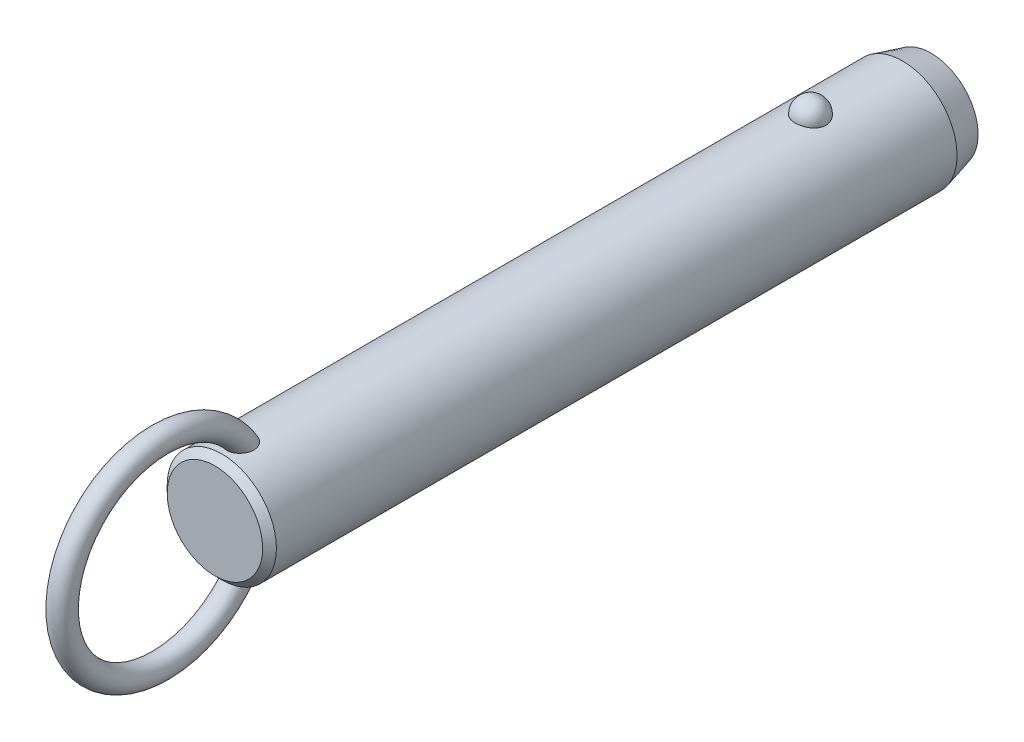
ISO-10303-21;
HEADER;
FILE_DESCRIPTION(('STEP AP214'),'2;1');
FILE_NAME('part.step','',(''),(''),'','','');
FILE_SCHEMA(('AUTOMOTIVE_DESIGN { 1 0 10303 214 1 1 1 1 }'));
ENDSEC;
DATA;
#1=APPLICATION_CONTEXT('core data for automotive mechanical design processes');
#2=APPLICATION_PROTOCOL_DEFINITION('international standard','automotive_design',2000,#1);
#3=PRODUCT_CONTEXT('',#1,'mechanical');
#4=PRODUCT('Part','Part','',(#3));
#5=PRODUCT_RELATED_PRODUCT_CATEGORY('part','',(#4));
#6=PRODUCT_DEFINITION_FORMATION('','',#4);
#7=PRODUCT_DEFINITION_CONTEXT('part definition',#1,'design');
#8=PRODUCT_DEFINITION('design','',#6,#7);
#9=PRODUCT_DEFINITION_SHAPE('','',#8);
#10=(LENGTH_UNIT() NAMED_UNIT(*) SI_UNIT(.MILLI.,.METRE.));
#11=(NAMED_UNIT(*) PLANE_ANGLE_UNIT() SI_UNIT($,.RADIAN.));
#12=(NAMED_UNIT(*) SI_UNIT($,.STERADIAN.) SOLID_ANGLE_UNIT());
#13=UNCERTAINTY_MEASURE_WITH_UNIT(LENGTH_MEASURE(1.E-05),#10,'distance_accuracy_value','');
#14=(GEOMETRIC_REPRESENTATION_CONTEXT(3) GLOBAL_UNCERTAINTY_ASSIGNED_CONTEXT((#13)) GLOBAL_UNIT_ASSIGNED_CONTEXT((#10,
#11,#12)) REPRESENTATION_CONTEXT('',''));
#15=CARTESIAN_POINT('',(0.,0.,0.));
#16=DIRECTION('',(0.,0.,1.));
#17=DIRECTION('',(1.,0.,0.));
#18=AXIS2_PLACEMENT_3D('',#15,#16,#17);
#19=CARTESIAN_POINT('',(0.,0.,91.4));
#20=DIRECTION('',(0.,0.,-1.));
#21=DIRECTION('',(-1.,0.,0.));
#22=AXIS2_PLACEMENT_3D('',#19,#20,#21);
#23=CYLINDRICAL_SURFACE('',#22,9.5);
#24=CARTESIAN_POINT('',(2.67259918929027,9.11631578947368,-2.70000000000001));
#25=CARTESIAN_POINT('',(2.6725968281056,9.11631786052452,-2.54909854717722));
#26=CARTESIAN_POINT('',(2.66030567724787,9.11994722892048,-2.39816735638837));
#27=CARTESIAN_POINT('',(2.6114347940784,9.13405924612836,-2.10058568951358));
#28=CARTESIAN_POINT('',(2.57484658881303,9.14454428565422,-1.95393672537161));
#29=CARTESIAN_POINT('',(2.47830875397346,9.17117631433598,-1.66916069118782));
#30=CARTESIAN_POINT('',(2.41836936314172,9.18732082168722,-1.53102991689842));
#31=CARTESIAN_POINT('',(2.27661331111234,9.22346780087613,-1.26705393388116));
#32=CARTESIAN_POINT('',(2.19479699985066,9.24347021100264,-1.14120852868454));
#33=CARTESIAN_POINT('',(2.01085282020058,9.28522401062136,-0.904632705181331));
#34=CARTESIAN_POINT('',(1.90862396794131,9.30698376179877,-0.793982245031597));
#35=CARTESIAN_POINT('',(1.6867437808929,9.34973971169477,-0.591607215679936));
#36=CARTESIAN_POINT('',(1.56709244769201,9.37073591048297,-0.499882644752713));
#37=CARTESIAN_POINT('',(1.31393976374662,9.40956370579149,-0.338167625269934));
#38=CARTESIAN_POINT('',(1.18048026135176,9.42740444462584,-0.268113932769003));
#39=CARTESIAN_POINT('',(0.903154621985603,9.45799906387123,-0.151390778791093));
#40=CARTESIAN_POINT('',(0.759289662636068,9.47075351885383,-0.10471867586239));
#41=CARTESIAN_POINT('',(0.46807402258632,9.48956256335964,-0.0367633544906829));
#42=CARTESIAN_POINT('',(0.320836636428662,9.49573643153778,-0.0150275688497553));
#43=CARTESIAN_POINT('',(0.02467145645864,9.50112183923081,0.00396199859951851));
#44=CARTESIAN_POINT('',(-0.124256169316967,9.50033406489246,0.00121819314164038));
#45=CARTESIAN_POINT('',(-0.417264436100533,9.4919475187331,-0.0284441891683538));
#46=CARTESIAN_POINT('',(-0.561384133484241,9.48444885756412,-0.055007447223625));
#47=CARTESIAN_POINT('',(-0.842986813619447,9.46357853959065,-0.131064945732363));
#48=CARTESIAN_POINT('',(-0.98046968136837,9.450206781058,-0.180559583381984));
#49=CARTESIAN_POINT('',(-1.24585005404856,9.41890822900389,-0.301476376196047));
#50=CARTESIAN_POINT('',(-1.37368611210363,9.40095498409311,-0.373026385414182));
#51=CARTESIAN_POINT('',(-1.61552738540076,9.36242964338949,-0.536025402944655));
#52=CARTESIAN_POINT('',(-1.72953116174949,9.34185727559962,-0.627476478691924));
#53=CARTESIAN_POINT('',(-1.9429225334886,9.29984568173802,-0.829844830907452));
#54=CARTESIAN_POINT('',(-2.04198021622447,9.27839736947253,-0.94110821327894));
#55=CARTESIAN_POINT('',(-2.2202646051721,9.23735994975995,-1.17883414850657));
#56=CARTESIAN_POINT('',(-2.29948985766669,9.21777097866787,-1.30529781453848));
#57=CARTESIAN_POINT('',(-2.43697287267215,9.18238994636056,-1.57158566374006));
#58=CARTESIAN_POINT('',(-2.49497068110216,9.16664569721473,-1.71155057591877));
#59=CARTESIAN_POINT('',(-2.5872073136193,9.14104303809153,-1.99961197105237));
#60=CARTESIAN_POINT('',(-2.62144683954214,9.13118445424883,-2.14770821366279));
#61=CARTESIAN_POINT('',(-2.66521466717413,9.11850622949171,-2.44715424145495));
#62=CARTESIAN_POINT('',(-2.67484831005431,9.11565658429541,-2.59848735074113));
#63=CARTESIAN_POINT('',(-2.66946735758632,9.11723375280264,-2.90067317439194));
#64=CARTESIAN_POINT('',(-2.65445345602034,9.12166036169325,-3.05152590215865));
#65=CARTESIAN_POINT('',(-2.60029711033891,9.13724422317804,-3.34766110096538));
#66=CARTESIAN_POINT('',(-2.56127978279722,9.14836656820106,-3.49296833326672));
#67=CARTESIAN_POINT('',(-2.46018844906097,9.17606676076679,-3.77477535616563));
#68=CARTESIAN_POINT('',(-2.39811349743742,9.1926448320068,-3.9112747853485));
#69=CARTESIAN_POINT('',(-2.25202303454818,9.22952198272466,-4.17244273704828));
#70=CARTESIAN_POINT('',(-2.16788714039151,9.24984129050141,-4.29704106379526));
#71=CARTESIAN_POINT('',(-1.9799408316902,9.29188255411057,-4.53013066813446));
#72=CARTESIAN_POINT('',(-1.87612963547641,9.31360456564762,-4.63862130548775));
#73=CARTESIAN_POINT('',(-1.65105429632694,9.35612959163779,-4.8369029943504));
#74=CARTESIAN_POINT('',(-1.52972405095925,9.37692871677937,-4.92661991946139));
#75=CARTESIAN_POINT('',(-1.27318250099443,9.41518970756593,-5.08429106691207));
#76=CARTESIAN_POINT('',(-1.13797219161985,9.432651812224,-5.15224684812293));
#77=CARTESIAN_POINT('',(-0.859280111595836,9.46208255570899,-5.26371827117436));
#78=CARTESIAN_POINT('',(-0.715925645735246,9.47411833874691,-5.30753421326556));
#79=CARTESIAN_POINT('',(-0.423550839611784,9.4916822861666,-5.37076321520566));
#80=CARTESIAN_POINT('',(-0.274531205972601,9.49721125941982,-5.39017930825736));
#81=CARTESIAN_POINT('',(0.021844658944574,9.50110860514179,-5.40390587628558));
#82=CARTESIAN_POINT('',(0.169177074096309,9.49961381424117,-5.39869609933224));
#83=CARTESIAN_POINT('',(0.460808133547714,9.48993906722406,-5.36441955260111));
#84=CARTESIAN_POINT('',(0.605106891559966,9.48175936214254,-5.33535367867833));
#85=CARTESIAN_POINT('',(0.886027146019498,9.4596376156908,-5.25435587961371));
#86=CARTESIAN_POINT('',(1.02267710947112,9.44571881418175,-5.20251612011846));
#87=CARTESIAN_POINT('',(1.28523827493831,9.41358993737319,-5.07741549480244));
#88=CARTESIAN_POINT('',(1.41114877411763,9.39537958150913,-5.00415322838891));
#89=CARTESIAN_POINT('',(1.65085227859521,9.3562644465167,-4.83684599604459));
#90=CARTESIAN_POINT('',(1.76442346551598,9.33532178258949,-4.74249218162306));
#91=CARTESIAN_POINT('',(1.97425672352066,9.29321198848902,-4.53620389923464));
#92=CARTESIAN_POINT('',(2.07051582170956,9.27204482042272,-4.42426641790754));
#93=CARTESIAN_POINT('',(2.24490086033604,9.23139221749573,-4.18363183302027));
#94=CARTESIAN_POINT('',(2.32267019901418,9.21194380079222,-4.05466990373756));
#95=CARTESIAN_POINT('',(2.45584092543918,9.1773419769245,-3.78517836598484));
#96=CARTESIAN_POINT('',(2.5112497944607,9.16218713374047,-3.64465264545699));
#97=CARTESIAN_POINT('',(2.59380876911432,9.13913522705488,-3.37104301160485));
#98=CARTESIAN_POINT('',(2.62330266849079,9.13064624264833,-3.23871053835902));
#99=CARTESIAN_POINT('',(2.66269870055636,9.11923566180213,-2.97092664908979));
#100=CARTESIAN_POINT('',(2.67260130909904,9.11631393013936,-2.83547530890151));
#101=CARTESIAN_POINT('',(2.67259918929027,9.11631578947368,-2.70000000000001));
#102=B_SPLINE_CURVE_WITH_KNOTS('',3,(#24,#25,#26,#27,#28,#29,#30,#31,#32,#33,#34,#35,#36,#37,
#38,#39,#40,#41,#42,#43,#44,#45,#46,#47,#48,#49,#50,#51,#52,#53,#54,#55,#56,#57,#58,#59,#60,#61,
#62,#63,#64,#65,#66,#67,#68,#69,#70,#71,#72,#73,#74,#75,#76,#77,#78,#79,#80,#81,#82,#83,#84,#85,
#86,#87,#88,#89,#90,#91,#92,#93,#94,#95,#96,#97,#98,#99,#100,#101),.UNSPECIFIED.,.T.,.F.,(4,2,2,
2,2,2,2,2,2,2,2,2,2,2,2,2,2,2,2,2,2,2,2,2,2,2,2,2,2,2,2,2,2,2,2,2,2,2,4),(0.,0.452217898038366,
0.904593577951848,1.35677112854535,1.80894144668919,2.26340676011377,2.71787203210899,
3.17099820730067,3.62407318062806,4.06878835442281,4.51345969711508,4.95160616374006,
5.38976021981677,5.83050358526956,6.27129275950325,6.72071308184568,7.17016633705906,
7.6249527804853,8.07972578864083,8.53254856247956,8.98535859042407,9.43582813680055,
9.88631615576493,10.3393155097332,10.7923328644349,11.2471065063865,11.7018475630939,
12.150795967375,12.599688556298,13.0398725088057,13.4800399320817,13.9184421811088,
14.3568730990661,14.802202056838,15.2476074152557,15.7010097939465,16.1542603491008,
16.5602594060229,16.966248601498),.UNSPECIFIED.);
#103=CARTESIAN_POINT('',(2.67259918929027,9.11631578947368,-2.70000000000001));
#104=VERTEX_POINT('',#103);
#105=EDGE_CURVE('E41',#104,#104,#102,.T.);
#106=ORIENTED_EDGE('',*,*,#105,.T.);
#107=EDGE_LOOP('',(#106));
#108=FACE_BOUND('',#107,.T.);
#109=CARTESIAN_POINT('',(0.,0.,99.7200000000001));
#110=DIRECTION('',(0.,0.,1.));
#111=DIRECTION('',(1.,0.,0.));
#112=AXIS2_PLACEMENT_3D('',#109,#110,#111);
#113=CIRCLE('',#112,9.5);
#114=CARTESIAN_POINT('',(9.5,0.,99.7200000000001));
#115=VERTEX_POINT('',#114);
#116=EDGE_CURVE('E10',#115,#115,#113,.F.);
#117=ORIENTED_EDGE('',*,*,#116,.T.);
#118=EDGE_LOOP('',(#117));
#119=FACE_BOUND('',#118,.T.);
#120=CARTESIAN_POINT('',(-0.697062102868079,-9.47439269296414,94.0678088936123));
#121=CARTESIAN_POINT('',(-0.799579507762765,-9.46685146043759,94.1074823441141));
#122=CARTESIAN_POINT('',(-0.898575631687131,-9.45788043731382,94.1559309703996));
#123=CARTESIAN_POINT('',(-1.08670047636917,-9.43811593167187,94.2688685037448));
#124=CARTESIAN_POINT('',(-1.17583204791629,-9.42732297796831,94.333352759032));
#125=CARTESIAN_POINT('',(-1.34179806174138,-9.40513672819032,94.4762099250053));
#126=CARTESIAN_POINT('',(-1.41865133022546,-9.39374438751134,94.5545611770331));
#127=CARTESIAN_POINT('',(-1.5586004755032,-9.37154196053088,94.7227524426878));
#128=CARTESIAN_POINT('',(-1.62169476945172,-9.3607319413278,94.8125937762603));
#129=CARTESIAN_POINT('',(-1.73527695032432,-9.34035749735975,95.0045001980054));
#130=CARTESIAN_POINT('',(-1.7852226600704,-9.33085270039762,95.1068910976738));
#131=CARTESIAN_POINT('',(-1.86924997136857,-9.3143834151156,95.318148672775));
#132=CARTESIAN_POINT('',(-1.90332570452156,-9.30741986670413,95.4270177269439));
#133=CARTESIAN_POINT('',(-1.95893603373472,-9.29588482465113,95.6604730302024));
#134=CARTESIAN_POINT('',(-1.97872420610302,-9.29165182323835,95.7854890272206));
#135=CARTESIAN_POINT('',(-2.00062129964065,-9.28695978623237,96.0370805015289));
#136=CARTESIAN_POINT('',(-2.00272284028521,-9.28650232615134,96.163656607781));
#137=CARTESIAN_POINT('',(-1.98958876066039,-9.28932750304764,96.4368157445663));
#138=CARTESIAN_POINT('',(-1.97143366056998,-9.2932400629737,96.5832519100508));
#139=CARTESIAN_POINT('',(-1.91479925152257,-9.30507151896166,96.8720629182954));
#140=CARTESIAN_POINT('',(-1.87629122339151,-9.31299607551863,97.014431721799));
#141=CARTESIAN_POINT('',(-1.77225683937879,-9.33340232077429,97.3151725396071));
#142=CARTESIAN_POINT('',(-1.70334898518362,-9.34641636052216,97.4723691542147));
#143=CARTESIAN_POINT('',(-1.58111062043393,-9.36759153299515,97.6975171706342));
#144=CARTESIAN_POINT('',(-1.53721459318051,-9.37492619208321,97.7707968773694));
#145=CARTESIAN_POINT('',(-1.44302631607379,-9.38988566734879,97.9130740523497));
#146=CARTESIAN_POINT('',(-1.39273721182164,-9.39751033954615,97.9820736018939));
#147=CARTESIAN_POINT('',(-1.26775962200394,-9.41530678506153,98.1369832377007));
#148=CARTESIAN_POINT('',(-1.19052326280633,-9.42548108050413,98.2208712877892));
#149=CARTESIAN_POINT('',(-1.02420241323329,-9.44499825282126,98.3760086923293));
#150=CARTESIAN_POINT('',(-0.935139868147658,-9.45434261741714,98.4472808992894));
#151=CARTESIAN_POINT('',(-0.766610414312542,-9.46930670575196,98.5586955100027));
#152=CARTESIAN_POINT('',(-0.689439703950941,-9.47529223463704,98.6022354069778));
#153=CARTESIAN_POINT('',(-0.528942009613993,-9.48560294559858,98.6763133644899));
#154=CARTESIAN_POINT('',(-0.445620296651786,-9.48992953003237,98.7068624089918));
#155=CARTESIAN_POINT('',(-0.273901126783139,-9.49644161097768,98.7525792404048));
#156=CARTESIAN_POINT('',(-0.185465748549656,-9.49860811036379,98.76761059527));
#157=CARTESIAN_POINT('',(-0.00734541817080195,-9.5004135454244,98.7801494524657));
#158=CARTESIAN_POINT('',(0.0823387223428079,-9.50005405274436,98.7776678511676));
#159=CARTESIAN_POINT('',(0.247679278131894,-9.49708301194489,98.7569959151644));
#160=CARTESIAN_POINT('',(0.323620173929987,-9.49477609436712,98.7409300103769));
#161=CARTESIAN_POINT('',(0.471981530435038,-9.48855917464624,98.6971726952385));
#162=CARTESIAN_POINT('',(0.544400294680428,-9.48464840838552,98.669475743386));
#163=CARTESIAN_POINT('',(0.70894789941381,-9.47398336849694,98.5928026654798));
#164=CARTESIAN_POINT('',(0.799149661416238,-9.46671310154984,98.5397745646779));
#165=CARTESIAN_POINT('',(0.969783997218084,-9.45076225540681,98.4199731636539));
#166=CARTESIAN_POINT('',(1.05019415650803,-9.44207854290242,98.3531692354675));
#167=CARTESIAN_POINT('',(1.23092343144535,-9.42051459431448,98.1807596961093));
#168=CARTESIAN_POINT('',(1.3265249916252,-9.40733378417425,98.0702619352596));
#169=CARTESIAN_POINT('',(1.49893121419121,-9.38140745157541,97.8355614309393));
#170=CARTESIAN_POINT('',(1.57571616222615,-9.36866239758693,97.7113445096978));
#171=CARTESIAN_POINT('',(1.71285426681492,-9.34457644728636,97.4493891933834));
#172=CARTESIAN_POINT('',(1.77266365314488,-9.33328726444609,97.3113623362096));
#173=CARTESIAN_POINT('',(1.87239208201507,-9.31379209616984,97.0280515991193));
#174=CARTESIAN_POINT('',(1.9123015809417,-9.3055875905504,96.882764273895));
#175=CARTESIAN_POINT('',(1.9760418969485,-9.29228394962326,96.5620281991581));
#176=CARTESIAN_POINT('',(1.99587438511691,-9.28797202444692,96.3857248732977));
#177=CARTESIAN_POINT('',(2.0029570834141,-9.28645519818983,96.0324146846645));
#178=CARTESIAN_POINT('',(1.99025930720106,-9.28923895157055,95.8554093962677));
#179=CARTESIAN_POINT('',(1.93735479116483,-9.30038134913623,95.5563381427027));
#180=CARTESIAN_POINT('',(1.90576827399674,-9.30697680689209,95.4326679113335));
#181=CARTESIAN_POINT('',(1.82287484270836,-9.32356855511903,95.192329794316));
#182=CARTESIAN_POINT('',(1.7715821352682,-9.33356239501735,95.0756569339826));
#183=CARTESIAN_POINT('',(1.64885744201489,-9.35602275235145,94.8527061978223));
#184=CARTESIAN_POINT('',(1.57730995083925,-9.36850332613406,94.7464927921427));
#185=CARTESIAN_POINT('',(1.41543264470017,-9.39431873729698,94.5495530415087));
#186=CARTESIAN_POINT('',(1.32510883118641,-9.40765330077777,94.4588217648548));
#187=CARTESIAN_POINT('',(1.13846223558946,-9.43195720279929,94.3050334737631));
#188=CARTESIAN_POINT('',(1.04369890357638,-9.44302894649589,94.2400947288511));
#189=CARTESIAN_POINT('',(0.843965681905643,-9.46296805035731,94.1280388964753));
#190=CARTESIAN_POINT('',(0.739000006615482,-9.4718363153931,94.0809144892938));
#191=CARTESIAN_POINT('',(0.528175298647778,-9.48586140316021,94.0081173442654));
#192=CARTESIAN_POINT('',(0.422686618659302,-9.49119633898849,93.9814024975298));
#193=CARTESIAN_POINT('',(0.20859011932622,-9.49831365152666,93.9460137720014));
#194=CARTESIAN_POINT('',(0.0999817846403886,-9.500095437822,93.9373428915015));
#195=CARTESIAN_POINT('',(-0.126104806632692,-9.49988861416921,93.9383501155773));
#196=CARTESIAN_POINT('',(-0.243578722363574,-9.49757821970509,93.9495942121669));
#197=CARTESIAN_POINT('',(-0.474390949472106,-9.48885165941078,93.993167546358));
#198=CARTESIAN_POINT('',(-0.587729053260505,-9.48243528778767,94.0254978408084));
#199=CARTESIAN_POINT('',(-0.697062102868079,-9.47439269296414,94.0678088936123));
#200=B_SPLINE_CURVE_WITH_KNOTS('',3,(#120,#121,#122,#123,#124,#125,#126,#127,#128,#129,#130,
#131,#132,#133,#134,#135,#136,#137,#138,#139,#140,#141,#142,#143,#144,#145,#146,#147,#148,#149,
#150,#151,#152,#153,#154,#155,#156,#157,#158,#159,#160,#161,#162,#163,#164,#165,#166,#167,#168,
#169,#170,#171,#172,#173,#174,#175,#176,#177,#178,#179,#180,#181,#182,#183,#184,#185,#186,#187,
#188,#189,#190,#191,#192,#193,#194,#195,#196,#197,#198,#199),.UNSPECIFIED.,.T.,.F.,(4,2,2,2,2,2,
2,2,2,2,2,2,2,2,2,2,2,2,2,2,2,2,2,2,2,2,2,2,2,2,2,2,2,2,2,2,2,2,2,4),(0.,0.330119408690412,
0.660143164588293,0.989655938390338,1.31920659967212,1.66074728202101,2.00241415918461,
2.38088696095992,2.7595176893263,3.20065679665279,3.6424200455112,4.15620996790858,
4.4131416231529,4.66994734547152,5.01228664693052,5.35399933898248,5.61943037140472,
5.88463652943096,6.15215502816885,6.41950709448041,6.65144391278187,6.88349136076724,
7.19641200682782,7.51003602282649,7.94779711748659,8.38601491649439,8.83699707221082,
9.28819530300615,9.8177866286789,10.3465317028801,10.7284172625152,11.110028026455,
11.4938603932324,11.8775702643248,12.2220189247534,12.5663259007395,12.8915939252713,
13.2169159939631,13.5689650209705,13.9210316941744),.UNSPECIFIED.);
#201=CARTESIAN_POINT('',(-0.697062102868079,-9.47439269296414,94.0678088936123));
#202=VERTEX_POINT('',#201);
#203=EDGE_CURVE('E58',#202,#202,#200,.T.);
#204=ORIENTED_EDGE('',*,*,#203,.T.);
#205=EDGE_LOOP('',(#204));
#206=FACE_BOUND('',#205,.T.);
#207=CARTESIAN_POINT('',(-0.697062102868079,9.47439269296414,94.0678088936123));
#208=CARTESIAN_POINT('',(-0.597792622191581,9.48169483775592,94.0293956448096));
#209=CARTESIAN_POINT('',(-0.495106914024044,9.48766580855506,93.9991682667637));
#210=CARTESIAN_POINT('',(-0.285876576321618,9.49627648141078,93.9560327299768));
#211=CARTESIAN_POINT('',(-0.179324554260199,9.49890941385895,93.9431597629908));
#212=CARTESIAN_POINT('',(0.0344157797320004,9.50053798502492,93.9351666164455));
#213=CARTESIAN_POINT('',(0.141603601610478,9.49953613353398,93.9400341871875));
#214=CARTESIAN_POINT('',(0.353563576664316,9.49401038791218,93.9673654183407));
#215=CARTESIAN_POINT('',(0.458336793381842,9.48948807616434,93.98982117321));
#216=CARTESIAN_POINT('',(0.66249373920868,9.4774236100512,94.0516719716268));
#217=CARTESIAN_POINT('',(0.761881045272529,9.46988348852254,94.0910556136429));
#218=CARTESIAN_POINT('',(0.952608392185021,9.45260382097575,94.1856342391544));
#219=CARTESIAN_POINT('',(1.04394806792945,9.44286417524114,94.2408299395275));
#220=CARTESIAN_POINT('',(1.21712767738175,9.42211760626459,94.3660662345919));
#221=CARTESIAN_POINT('',(1.29885671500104,9.41109835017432,94.4362579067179));
#222=CARTESIAN_POINT('',(1.44978975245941,9.38903310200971,94.5889801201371));
#223=CARTESIAN_POINT('',(1.51899278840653,9.37798710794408,94.6715116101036));
#224=CARTESIAN_POINT('',(1.64602857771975,9.35654375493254,94.8497763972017));
#225=CARTESIAN_POINT('',(1.70333052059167,9.34618688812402,94.945891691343));
#226=CARTESIAN_POINT('',(1.80259341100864,9.32755128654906,95.145897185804));
#227=CARTESIAN_POINT('',(1.84454942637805,9.31927322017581,95.2497898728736));
#228=CARTESIAN_POINT('',(1.91637039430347,9.30478365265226,95.472213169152));
#229=CARTESIAN_POINT('',(1.944805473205,9.29882552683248,95.5912192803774));
#230=CARTESIAN_POINT('',(1.98449865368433,9.29043398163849,95.8321436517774));
#231=CARTESIAN_POINT('',(1.99574908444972,9.28800213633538,95.9540631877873));
#232=CARTESIAN_POINT('',(2.00275141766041,9.28649645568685,96.2169324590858));
#233=CARTESIAN_POINT('',(1.99588238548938,9.28799035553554,96.3579529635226));
#234=CARTESIAN_POINT('',(1.96270559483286,9.29505517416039,96.6376217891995));
#235=CARTESIAN_POINT('',(1.93637872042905,9.30063010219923,96.776267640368));
#236=CARTESIAN_POINT('',(1.85949176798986,9.31633564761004,97.0725616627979));
#237=CARTESIAN_POINT('',(1.80549792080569,9.3270926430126,97.2292907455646));
#238=CARTESIAN_POINT('',(1.67376869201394,9.3516306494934,97.5322840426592));
#239=CARTESIAN_POINT('',(1.59603181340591,9.36541185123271,97.6785475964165));
#240=CARTESIAN_POINT('',(1.4360277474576,9.39110706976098,97.9258138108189));
#241=CARTESIAN_POINT('',(1.35831795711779,9.40278656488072,98.029791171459));
#242=CARTESIAN_POINT('',(1.18774483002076,9.42585025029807,98.2245347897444));
#243=CARTESIAN_POINT('',(1.09490932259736,9.43723493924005,98.3153247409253));
#244=CARTESIAN_POINT('',(0.921110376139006,9.45552616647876,98.4562033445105));
#245=CARTESIAN_POINT('',(0.843738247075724,9.46281058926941,98.5106563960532));
#246=CARTESIAN_POINT('',(0.681245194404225,9.47589120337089,98.606711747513));
#247=CARTESIAN_POINT('',(0.596135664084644,9.48168953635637,98.6483325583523));
#248=CARTESIAN_POINT('',(0.433779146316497,9.49038144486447,98.7100899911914));
#249=CARTESIAN_POINT('',(0.357459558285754,9.49359170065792,98.7326013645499));
#250=CARTESIAN_POINT('',(0.202074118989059,9.49816761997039,98.7645745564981));
#251=CARTESIAN_POINT('',(0.123010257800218,9.49953459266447,98.7740456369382));
#252=CARTESIAN_POINT('',(-0.0357372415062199,9.50026497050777,98.7791143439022));
#253=CARTESIAN_POINT('',(-0.115421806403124,9.49962433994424,98.7746840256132));
#254=CARTESIAN_POINT('',(-0.272823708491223,9.49640854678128,98.7522962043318));
#255=CARTESIAN_POINT('',(-0.350540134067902,9.4938325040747,98.7343325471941));
#256=CARTESIAN_POINT('',(-0.500580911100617,9.4870946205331,98.6868028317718));
#257=CARTESIAN_POINT('',(-0.572979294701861,9.48296359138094,98.6574618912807));
#258=CARTESIAN_POINT('',(-0.712864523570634,9.47347609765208,98.5890087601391));
#259=CARTESIAN_POINT('',(-0.780349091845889,9.46811906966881,98.5498920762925));
#260=CARTESIAN_POINT('',(-0.94630921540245,9.45329720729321,98.4394327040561));
#261=CARTESIAN_POINT('',(-1.04090230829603,9.44321512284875,98.3623297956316));
#262=CARTESIAN_POINT('',(-1.21661929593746,9.42219227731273,98.1940971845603));
#263=CARTESIAN_POINT('',(-1.2977051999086,9.41124921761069,98.1029292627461));
#264=CARTESIAN_POINT('',(-1.47319646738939,9.38563439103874,97.8761621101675));
#265=CARTESIAN_POINT('',(-1.5620887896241,9.37102009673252,97.7362895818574));
#266=CARTESIAN_POINT('',(-1.71623987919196,9.34401559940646,97.4439503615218));
#267=CARTESIAN_POINT('',(-1.78147866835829,9.33162728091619,97.291473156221));
#268=CARTESIAN_POINT('',(-1.88853837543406,9.31055541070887,96.9756470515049));
#269=CARTESIAN_POINT('',(-1.92998995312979,9.30193076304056,96.8121685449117));
#270=CARTESIAN_POINT('',(-1.98590726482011,9.29015757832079,96.4805268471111));
#271=CARTESIAN_POINT('',(-2.0004070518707,9.2870021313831,96.3123698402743));
#272=CARTESIAN_POINT('',(-1.99964701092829,9.28716218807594,96.0050806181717));
#273=CARTESIAN_POINT('',(-1.98908145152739,9.28945704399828,95.8659362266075));
#274=CARTESIAN_POINT('',(-1.94566294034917,9.29865169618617,95.5911539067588));
#275=CARTESIAN_POINT('',(-1.91282062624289,9.30554929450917,95.455514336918));
#276=CARTESIAN_POINT('',(-1.84582133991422,9.31898248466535,95.2578026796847));
#277=CARTESIAN_POINT('',(-1.82038084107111,9.32400364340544,95.192583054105));
#278=CARTESIAN_POINT('',(-1.7635051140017,9.33492884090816,95.0649033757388));
#279=CARTESIAN_POINT('',(-1.73207305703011,9.34083241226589,95.0024418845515));
#280=CARTESIAN_POINT('',(-1.6632424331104,9.353333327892,94.8809407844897));
#281=CARTESIAN_POINT('',(-1.62584239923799,9.35993084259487,94.821902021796));
#282=CARTESIAN_POINT('',(-1.54527678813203,9.37356864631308,94.7079875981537));
#283=CARTESIAN_POINT('',(-1.50211241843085,9.38060884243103,94.6531110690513));
#284=CARTESIAN_POINT('',(-1.37681147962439,9.40004442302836,94.509961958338));
#285=CARTESIAN_POINT('',(-1.28916358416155,9.41261047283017,94.4264295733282));
#286=CARTESIAN_POINT('',(-1.09996826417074,9.43658180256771,94.2772360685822));
#287=CARTESIAN_POINT('',(-0.99846185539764,9.44799034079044,94.2115238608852));
#288=CARTESIAN_POINT('',(-0.860188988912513,9.46103017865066,94.1394367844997));
#289=CARTESIAN_POINT('',(-0.828141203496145,9.46389141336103,94.1238511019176));
#290=CARTESIAN_POINT('',(-0.763210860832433,9.46934915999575,94.0944734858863));
#291=CARTESIAN_POINT('',(-0.730328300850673,9.47194567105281,94.0806815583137));
#292=CARTESIAN_POINT('',(-0.697062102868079,9.47439269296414,94.0678088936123));
#293=B_SPLINE_CURVE_WITH_KNOTS('',3,(#207,#208,#209,#210,#211,#212,#213,#214,#215,#216,#217,
#218,#219,#220,#221,#222,#223,#224,#225,#226,#227,#228,#229,#230,#231,#232,#233,#234,#235,#236,
#237,#238,#239,#240,#241,#242,#243,#244,#245,#246,#247,#248,#249,#250,#251,#252,#253,#254,#255,
#256,#257,#258,#259,#260,#261,#262,#263,#264,#265,#266,#267,#268,#269,#270,#271,#272,#273,#274,
#275,#276,#277,#278,#279,#280,#281,#282,#283,#284,#285,#286,#287,#288,#289,#290,#291,#292),
.UNSPECIFIED.,.T.,.F.,(4,2,2,2,2,2,2,2,2,2,2,2,2,2,2,2,2,2,2,2,2,2,2,2,2,2,2,2,2,2,2,2,2,2,2,2,
2,2,2,2,2,2,4),(0.,0.31994216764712,0.640532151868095,0.960900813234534,1.28112555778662,
1.60113495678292,1.92115886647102,2.24457323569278,2.56801248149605,2.90371927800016,
3.23953387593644,3.60560313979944,3.97183576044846,4.39383693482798,4.81625324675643,
5.31257045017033,5.80891895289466,6.19868344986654,6.58773876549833,6.87145417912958,
7.15475838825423,7.3926375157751,7.63034760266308,7.86853584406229,8.10683246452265,
8.3406366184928,8.57454843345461,8.93983939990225,9.30614105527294,9.80266668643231,
10.2996107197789,10.8040753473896,11.3079021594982,11.7249776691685,12.1418541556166,
12.3521485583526,12.562331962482,12.7725671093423,12.9827582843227,13.345827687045,
13.7078449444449,13.8150604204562,13.9222762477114),.UNSPECIFIED.);
#294=CARTESIAN_POINT('',(-0.697062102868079,9.47439269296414,94.0678088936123));
#295=VERTEX_POINT('',#294);
#296=EDGE_CURVE('E66',#295,#295,#293,.T.);
#297=ORIENTED_EDGE('',*,*,#296,.T.);
#298=EDGE_LOOP('',(#297));
#299=FACE_BOUND('',#298,.T.);
#300=CARTESIAN_POINT('',(0.,0.,-18.7));
#301=DIRECTION('',(0.,0.,-1.));
#302=DIRECTION('',(-1.,0.,0.));
#303=AXIS2_PLACEMENT_3D('',#300,#301,#302);
#304=CIRCLE('',#303,9.5);
#305=CARTESIAN_POINT('',(-9.5,0.,-18.7));
#306=VERTEX_POINT('',#305);
#307=EDGE_CURVE('E55',#306,#306,#304,.F.);
#308=ORIENTED_EDGE('',*,*,#307,.T.);
#309=EDGE_LOOP('',(#308));
#310=FACE_BOUND('',#309,.T.);
#311=ADVANCED_FACE('F37',(#108,#119,#206,#299,#310),#23,.T.);
#312=CARTESIAN_POINT('',(0.,0.,-23.7));
#313=DIRECTION('',(0.,0.,-1.));
#314=DIRECTION('',(-1.,0.,0.));
#315=AXIS2_PLACEMENT_3D('',#312,#313,#314);
#316=PLANE('',#315);
#317=CARTESIAN_POINT('',(0.,0.,-23.7));
#318=DIRECTION('',(0.,0.,-1.));
#319=DIRECTION('',(-1.,0.,0.));
#320=AXIS2_PLACEMENT_3D('',#317,#318,#319);
#321=CIRCLE('',#320,8.16025403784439);
#322=CARTESIAN_POINT('',(-8.16025403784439,0.,-23.7));
#323=VERTEX_POINT('',#322);
#324=EDGE_CURVE('E65',#323,#323,#321,.T.);
#325=ORIENTED_EDGE('',*,*,#324,.T.);
#326=EDGE_LOOP('',(#325));
#327=FACE_BOUND('',#326,.T.);
#328=ADVANCED_FACE('F84',(#327),#316,.T.);
#329=CARTESIAN_POINT('',(0.,0.,-23.7));
#330=DIRECTION('',(0.,0.,1.));
#331=DIRECTION('',(1.,0.,0.));
#332=AXIS2_PLACEMENT_3D('',#329,#330,#331);
#333=CONICAL_SURFACE('',#332,8.16025403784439,0.26179938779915);
#334=ORIENTED_EDGE('',*,*,#307,.F.);
#335=EDGE_LOOP('',(#334));
#336=FACE_BOUND('',#335,.T.);
#337=ORIENTED_EDGE('',*,*,#324,.F.);
#338=EDGE_LOOP('',(#337));
#339=FACE_BOUND('',#338,.T.);
#340=ADVANCED_FACE('F82',(#336,#339),#333,.T.);
#341=CARTESIAN_POINT('',(0.,0.,100.92));
#342=DIRECTION('',(0.,0.,1.));
#343=DIRECTION('',(1.,0.,0.));
#344=AXIS2_PLACEMENT_3D('',#341,#342,#343);
#345=PLANE('',#344);
#346=CARTESIAN_POINT('',(0.,0.,100.92));
#347=DIRECTION('',(0.,0.,1.));
#348=DIRECTION('',(1.,0.,0.));
#349=AXIS2_PLACEMENT_3D('',#346,#347,#348);
#350=CIRCLE('',#349,8.30000000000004);
#351=CARTESIAN_POINT('',(8.30000000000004,0.,100.92));
#352=VERTEX_POINT('',#351);
#353=EDGE_CURVE('E50',#352,#352,#350,.T.);
#354=ORIENTED_EDGE('',*,*,#353,.T.);
#355=EDGE_LOOP('',(#354));
#356=FACE_BOUND('',#355,.T.);
#357=ADVANCED_FACE('F76',(#356),#345,.T.);
#358=CARTESIAN_POINT('',(0.,0.,110.45));
#359=DIRECTION('',(1.,0.,0.));
#360=DIRECTION('',(0.,0.,-1.));
#361=AXIS2_PLACEMENT_3D('',#358,#359,#360);
#362=TOROIDAL_SURFACE('',#361,17.05,2.);
#363=ORIENTED_EDGE('',*,*,#296,.F.);
#364=EDGE_LOOP('',(#363));
#365=FACE_BOUND('',#364,.T.);
#366=ORIENTED_EDGE('',*,*,#203,.F.);
#367=EDGE_LOOP('',(#366));
#368=FACE_BOUND('',#367,.T.);
#369=ADVANCED_FACE('F72',(#365,#368),#362,.T.);
#370=CARTESIAN_POINT('',(0.,0.,100.92));
#371=DIRECTION('',(0.,0.,-1.));
#372=DIRECTION('',(-1.,0.,0.));
#373=AXIS2_PLACEMENT_3D('',#370,#371,#372);
#374=CONICAL_SURFACE('',#373,8.30000000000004,0.785398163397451);
#375=ORIENTED_EDGE('',*,*,#116,.F.);
#376=EDGE_LOOP('',(#375));
#377=FACE_BOUND('',#376,.T.);
#378=ORIENTED_EDGE('',*,*,#353,.F.);
#379=EDGE_LOOP('',(#378));
#380=FACE_BOUND('',#379,.T.);
#381=ADVANCED_FACE('F39',(#377,#380),#374,.T.);
#382=CARTESIAN_POINT('',(0.,9.5,-2.70000000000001));
#383=DIRECTION('',(0.,1.,0.));
#384=DIRECTION('',(0.,0.,-1.));
#385=AXIS2_PLACEMENT_3D('',#382,#383,#384);
#386=SPHERICAL_SURFACE('',#385,2.7);
#387=ORIENTED_EDGE('',*,*,#105,.F.);
#388=EDGE_LOOP('',(#387));
#389=FACE_BOUND('',#388,.T.);
#390=ADVANCED_FACE('F78',(#389),#386,.T.);
#391=CLOSED_SHELL('',(#311,#328,#340,#357,#369,#381,#390));
#392=MANIFOLD_SOLID_BREP('B2',#391);
#393=ADVANCED_BREP_SHAPE_REPRESENTATION('',(#18,#392),#14);
#394=SHAPE_DEFINITION_REPRESENTATION(#9,#393);
ENDSEC;
END-ISO-10303-21;
